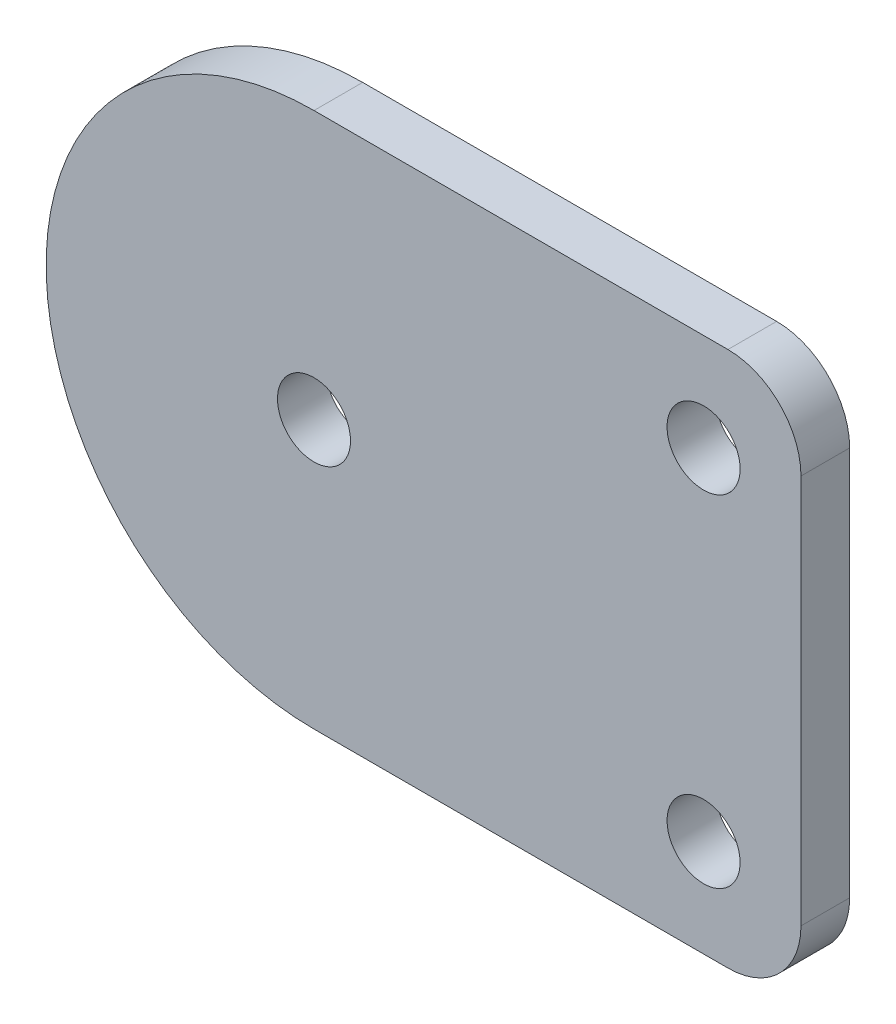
from build123d import *

# Parameters (mm, degrees)
ESQUISSE1_R      = 1.5
EXTRUSION1_DEPTH = 2


with BuildPart() as part:
    # Esquisse1 → Extrusion1 (new body)
    with BuildSketch(Plane.XY):
        with BuildLine():
            Line((0, 11), (17, 11))
            ThreePointArc((17, 11), (19.121320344, 10.121320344), (20, 8))
            Line((20, 8), (20, -8))
            ThreePointArc((20, -8), (19.121320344, -10.121320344), (17, -11))
            Line((17, -11), (0, -11))
            ThreePointArc((0, -11), (-11, 0), (0, 11))
        make_face()
        with Locations((16, 7)):
            Circle(ESQUISSE1_R, mode=Mode.SUBTRACT)
        Circle(ESQUISSE1_R, mode=Mode.SUBTRACT)
        with Locations(Location((16, -7, 0), (0, 0, 180))):
            Circle(ESQUISSE1_R, mode=Mode.SUBTRACT)
    extrude(amount=EXTRUSION1_DEPTH)


solid = part.part
